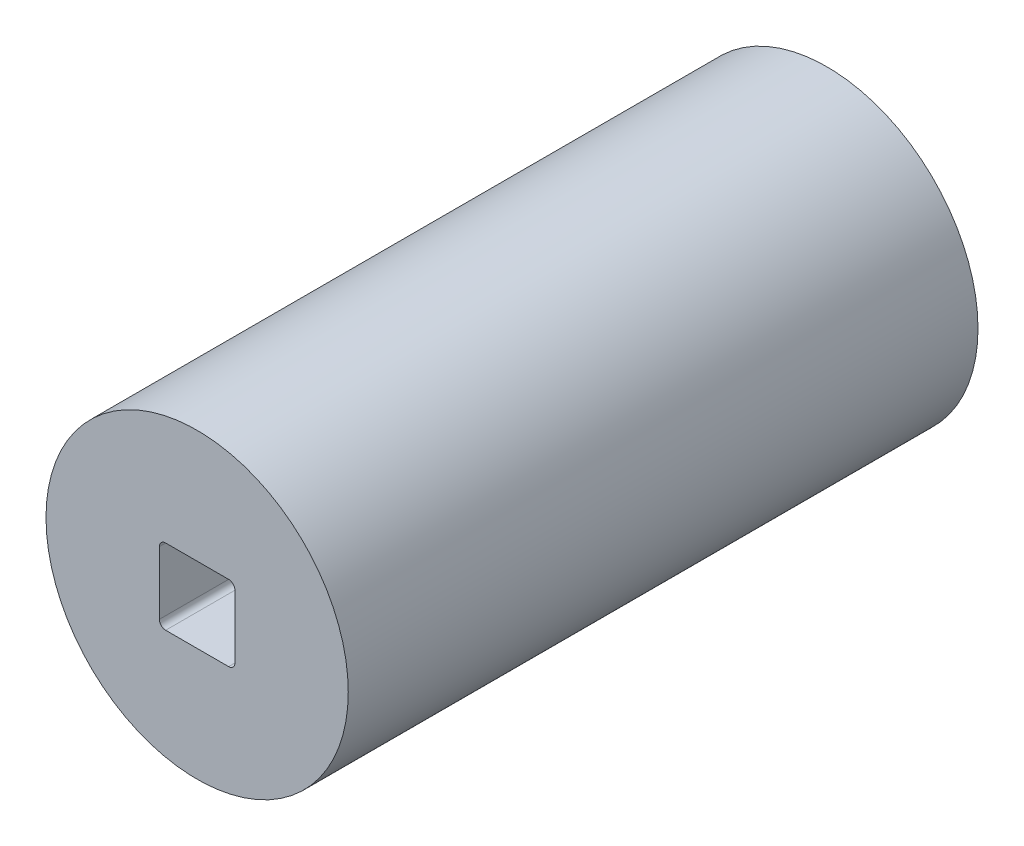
from build123d import *

# Parameters (mm, degrees)
SKETCH1_R           = 304.8
BOSS_EXTRUDE1_DEPTH = 1270
CUT_EXTRUDE1_DEPTH  = 1228.725
CUT_EXTRUDE2_DEPTH  = 19.05


with BuildPart() as part:
    # Sketch1 → Boss-Extrude1 (new body)
    with BuildSketch(Plane(origin=(0, 0, 0), x_dir=(0, 1, 0), z_dir=(0, 0, 1))):
        with Locations(Location((0, 0, 0), (0, 0, 270))):
            Circle(SKETCH1_R)
    extrude(amount=-BOSS_EXTRUDE1_DEPTH)

    # Sketch3 → Cut-Extrude1 (cut)
    with BuildSketch(Plane(origin=(0, 0, 0), x_dir=(0, 1, 0), z_dir=(0, 0, 1))):
        with BuildLine():
            Line((-63.5, -76.2), (63.5, -76.2))
            ThreePointArc((63.5, -76.2), (72.480256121, -72.480256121), (76.2, -63.5))
            Line((76.2, -63.5), (76.2, 63.5))
            ThreePointArc((76.2, 63.5), (72.480256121, 72.480256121), (63.5, 76.2))
            Line((63.5, 76.2), (-63.5, 76.2))
            ThreePointArc((-63.5, 76.2), (-72.480256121, 72.480256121), (-76.2, 63.5))
            Line((-76.2, 63.5), (-76.2, -63.5))
            ThreePointArc((-76.2, -63.5), (-72.480256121, -72.480256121), (-63.5, -76.2))
        make_face()
    extrude(amount=-CUT_EXTRUDE1_DEPTH, mode=Mode.SUBTRACT)

    # Sketch4 → Cut-Extrude2 (cut)
    with BuildSketch(Plane(origin=(0, 0, -1228.725), x_dir=(0, -1, 0), z_dir=(0, 0, 1))):
        Polygon((131.982271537, -228.6), (263.964543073, 0), (131.982271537, 228.6), (-131.982271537, 228.6), (-263.964543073, 0), (-131.982271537, -228.6), align=None)
    extrude(amount=CUT_EXTRUDE2_DEPTH, mode=Mode.SUBTRACT)


solid = part.part
